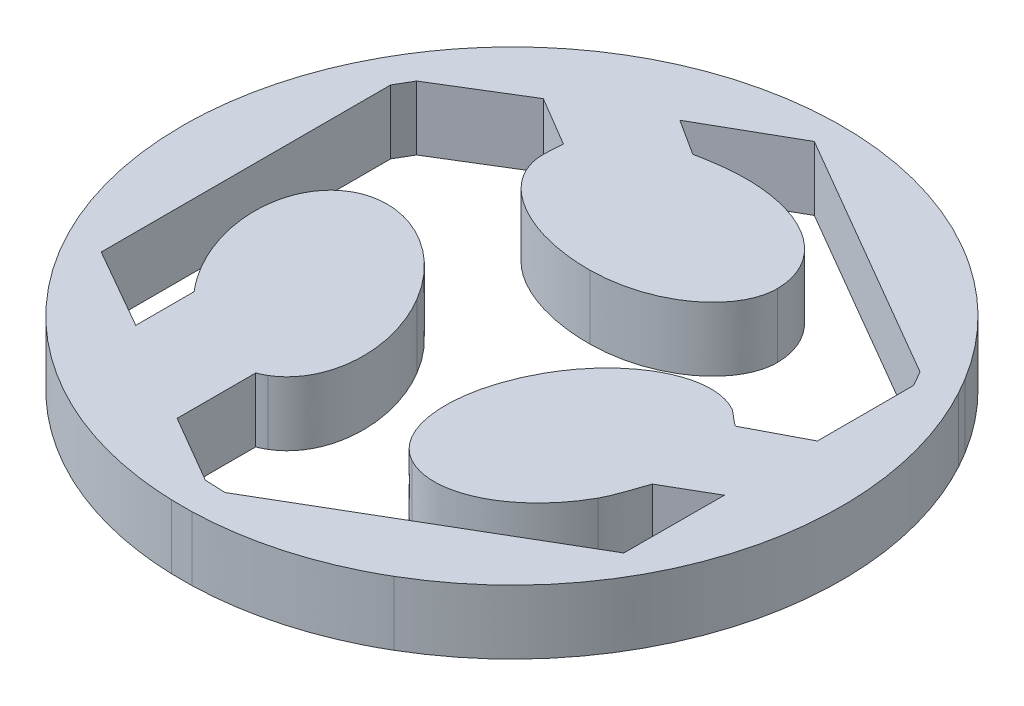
from build123d import *

# Parameters (mm, degrees)
AUFSATZ_LINEAR_AUSTRAGEN1_DEPTH = 15


with BuildPart() as part:
    # Skizze1 → Aufsatz-Linear austragen1 (new body)
    with BuildSketch(Plane(origin=(0, 0, 0), x_dir=(1, 0, 0), z_dir=(0, 1, 0))):
        with BuildLine():
            add(Edge.make_bspline(
                [(82.209076, 34.803937), (94.753289, 35.151917), (107.389789, 38.572732), (118.982913, 45.360741)],
                knots=[0, 0, 0, 0, 1, 1, 1, 1], degree=3))
            add(Edge.make_bspline(
                [(118.982913, 45.360741), (155.002936, 66.452901), (167.592022, 112.206486), (147.852553, 148.631779)],
                knots=[0, 0, 0, 0, 1, 1, 1, 1], degree=3))
            Line((147.852553, 148.631779), (145.85696, 152.103959))
            add(Edge.make_bspline(
                [(145.85696, 152.103959), (139.336216, 162.825581), (130.10134, 172.104201), (118.458544, 178.807543)],
                knots=[0, 0, 0, 0, 1, 1, 1, 1], degree=3))
            add(Edge.make_bspline(
                [(118.458544, 178.807543), (82.283864, 199.634697), (36.30676, 187.886632), (14.458244, 152.685619)],
                knots=[0, 0, 0, 0, 1, 1, 1, 1], degree=3))
            Line((14.458244, 152.685619), (12.293882, 148.980323))
            add(Edge.make_bspline(
                [(12.293882, 148.980323), (6.25602, 137.979583), (2.822222, 125.346752), (2.822222, 111.91241)],
                knots=[0, 0, 0, 0, 1, 1, 1, 1], degree=3))
            add(Edge.make_bspline(
                [(2.822222, 111.91241), (2.822222, 70.170615), (35.94354, 36.18739), (77.351467, 34.81579)],
                knots=[0, 0, 0, 0, 1, 1, 1, 1], degree=3))
            Line((77.351467, 34.81579), (82.209076, 34.803937))
        make_face()
        with BuildLine():
            add(Edge.make_bspline(
                [(97.521324, 70.98031), (106.418944, 66.023923), (119.667302, 71.970628), (126.986171, 85.10525)],
                knots=[0, 0, 0, 0, 1, 1, 1, 1], degree=3))
            add(Edge.make_bspline(
                [(126.986171, 85.10525), (128.166424, 87.224175), (129.742636, 92.143308), (130.479518, 94.294123)],
                knots=[0, 0, 0, 0, 1, 1, 1, 1], degree=3))
            Line((130.479518, 94.294123), (141.186464, 100.483821))
            Line((141.186464, 100.483821), (141.122964, 76.98233))
            Line((141.122964, 76.98233), (82.180571, 42.559686))
            Line((82.180571, 42.559686), (77.358522, 42.768248))
            Line((77.358522, 42.768248), (61.525009, 51.995503))
            Line((61.525009, 51.995503), (61.525009, 70.397239))
            add(Edge.make_bspline(
                [(61.525009, 70.397239), (62.185409, 70.649828), (62.829722, 70.951241), (63.448353, 71.316437)],
                knots=[0, 0, 0, 0, 1, 1, 1, 1], degree=3))
            add(Edge.make_bspline(
                [(63.448353, 71.316437), (72.221796, 76.488723), (73.144098, 91.18347), (65.5066, 104.135495)],
                knots=[0, 0, 0, 0, 1, 1, 1, 1], degree=3))
            add(Edge.make_bspline(
                [(65.5066, 104.135495), (57.869949, 117.088083), (44.56684, 123.394339), (35.79368, 118.22177)],
                knots=[0, 0, 0, 0, 1, 1, 1, 1], degree=3))
            add(Edge.make_bspline(
                [(35.79368, 118.22177), (27.020238, 113.048919), (26.098218, 98.355019), (33.734304, 85.402712)],
                knots=[0, 0, 0, 0, 1, 1, 1, 1], degree=3))
            add(Edge.make_bspline(
                [(33.734304, 85.402712), (34.966487, 83.313421), (36.347118, 81.400237), (37.831324, 79.67727)],
                knots=[0, 0, 0, 0, 1, 1, 1, 1], degree=3))
            Line((37.831324, 79.67727), (37.831324, 66.006708))
            Line((37.831324, 66.006708), (18.921871, 76.828237))
            Line((18.921871, 76.828237), (18.921871, 144.605032))
            Line((18.921871, 144.605032), (21.18106, 148.440432))
            Line((21.18106, 148.440432), (39.56304, 159.694043))
            Line((39.56304, 159.694043), (51.120604, 152.84451))
            add(Edge.make_bspline(
                [(51.120604, 152.84451), (50.892851, 150.945437), (50.885513, 148.854735), (50.892851, 148.135915)],
                knots=[0, 0, 0, 0, 1, 1, 1, 1], degree=3))
            add(Edge.make_bspline(
                [(50.892851, 148.135915), (50.998684, 137.951926), (64.790884, 130.210006), (79.826273, 130.365792)],
                knots=[0, 0, 0, 0, 1, 1, 1, 1], degree=3))
            add(Edge.make_bspline(
                [(79.826273, 130.365792), (94.861662, 130.521579), (105.570302, 139.630301), (105.494384, 148.591703)],
                knots=[0, 0, 0, 0, 1, 1, 1, 1], degree=3))
            add(Edge.make_bspline(
                [(105.494384, 148.591703), (105.408589, 158.77541), (95.615478, 166.748752), (80.585733, 167.196921)],
                knots=[0, 0, 0, 0, 1, 1, 1, 1], degree=3))
            add(Edge.make_bspline(
                [(80.585733, 167.196921), (75.497549, 167.348757), (70.592809, 166.332757), (68.359302, 165.906037)],
                knots=[0, 0, 0, 0, 1, 1, 1, 1], degree=3))
            Line((68.359302, 165.906037), (59.929889, 171.298175))
            Line((59.929889, 171.298175), (79.978109, 182.736923))
            Line((79.978109, 182.736923), (139.078829, 148.383423))
            Line((139.078829, 148.383423), (141.073011, 144.908986))
            Line((141.073011, 144.908986), (141.073011, 122.35435))
            Line((141.073011, 122.35435), (128.505091, 115.785063))
            add(Edge.make_bspline(
                [(128.505091, 115.785063), (128.049584, 115.861263), (125.259818, 118.472383), (124.632156, 118.822903)],
                knots=[0, 0, 0, 0, 1, 1, 1, 1], degree=3))
            add(Edge.make_bspline(
                [(124.632156, 118.822903), (115.734818, 123.779572), (102.63632, 117.225808), (95.31858, 104.090621)],
                knots=[0, 0, 0, 0, 1, 1, 1, 1], degree=3))
            add(Edge.make_bspline(
                [(95.31858, 104.090621), (88.000558, 90.955999), (88.624551, 75.938108), (97.521324, 70.98031)],
                knots=[0, 0, 0, 0, 1, 1, 1, 1], degree=3))
        make_face(mode=Mode.SUBTRACT)
    extrude(amount=AUFSATZ_LINEAR_AUSTRAGEN1_DEPTH)


solid = part.part
